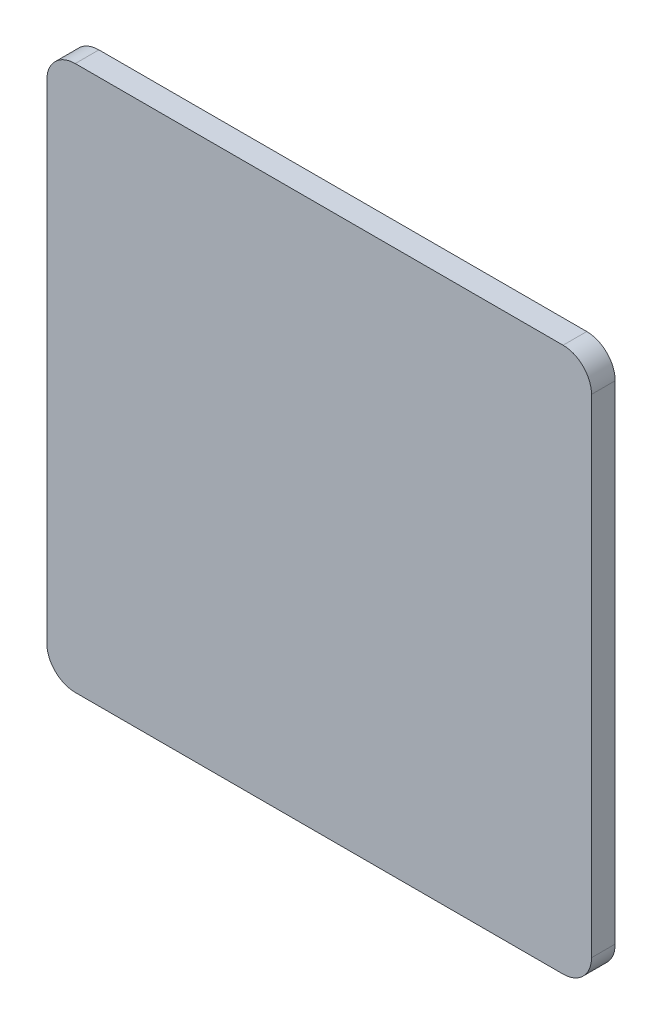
ISO-10303-21;
HEADER;
FILE_DESCRIPTION(('STEP AP214'),'2;1');
FILE_NAME('part.step','',(''),(''),'','','');
FILE_SCHEMA(('AUTOMOTIVE_DESIGN { 1 0 10303 214 1 1 1 1 }'));
ENDSEC;
DATA;
#1=APPLICATION_CONTEXT('core data for automotive mechanical design processes');
#2=APPLICATION_PROTOCOL_DEFINITION('international standard','automotive_design',2000,#1);
#3=PRODUCT_CONTEXT('',#1,'mechanical');
#4=PRODUCT('Part','Part','',(#3));
#5=PRODUCT_RELATED_PRODUCT_CATEGORY('part','',(#4));
#6=PRODUCT_DEFINITION_FORMATION('','',#4);
#7=PRODUCT_DEFINITION_CONTEXT('part definition',#1,'design');
#8=PRODUCT_DEFINITION('design','',#6,#7);
#9=PRODUCT_DEFINITION_SHAPE('','',#8);
#10=(LENGTH_UNIT() NAMED_UNIT(*) SI_UNIT(.MILLI.,.METRE.));
#11=(NAMED_UNIT(*) PLANE_ANGLE_UNIT() SI_UNIT($,.RADIAN.));
#12=(NAMED_UNIT(*) SI_UNIT($,.STERADIAN.) SOLID_ANGLE_UNIT());
#13=UNCERTAINTY_MEASURE_WITH_UNIT(LENGTH_MEASURE(1.E-05),#10,'distance_accuracy_value','');
#14=(GEOMETRIC_REPRESENTATION_CONTEXT(3) GLOBAL_UNCERTAINTY_ASSIGNED_CONTEXT((#13)) GLOBAL_UNIT_ASSIGNED_CONTEXT((#10,
#11,#12)) REPRESENTATION_CONTEXT('',''));
#15=CARTESIAN_POINT('',(0.,0.,0.));
#16=DIRECTION('',(0.,0.,1.));
#17=DIRECTION('',(1.,0.,0.));
#18=AXIS2_PLACEMENT_3D('',#15,#16,#17);
#19=CARTESIAN_POINT('',(65.405,65.405,212.895890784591));
#20=DIRECTION('',(0.,0.,-1.));
#21=DIRECTION('',(-1.,0.,0.));
#22=AXIS2_PLACEMENT_3D('',#19,#20,#21);
#23=CYLINDRICAL_SURFACE('',#22,7.62);
#24=CARTESIAN_POINT('',(65.405,65.405,6.34999999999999));
#25=DIRECTION('',(0.,0.,1.));
#26=DIRECTION('',(1.,0.,0.));
#27=AXIS2_PLACEMENT_3D('',#24,#25,#26);
#28=CIRCLE('',#27,7.62);
#29=CARTESIAN_POINT('',(73.025,65.405,6.34999999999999));
#30=VERTEX_POINT('',#29);
#31=CARTESIAN_POINT('',(65.405,73.025,6.34999999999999));
#32=VERTEX_POINT('',#31);
#33=EDGE_CURVE('E129',#30,#32,#28,.T.);
#34=ORIENTED_EDGE('',*,*,#33,.F.);
#35=DIRECTION('',(0.,0.,-1.));
#36=VECTOR('',#35,1.);
#37=CARTESIAN_POINT('',(73.025,65.405,212.895890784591));
#38=LINE('',#37,#36);
#39=CARTESIAN_POINT('',(73.025,65.405,0.));
#40=VERTEX_POINT('',#39);
#41=EDGE_CURVE('E34',#30,#40,#38,.T.);
#42=ORIENTED_EDGE('',*,*,#41,.T.);
#43=CARTESIAN_POINT('',(65.405,65.405,0.));
#44=DIRECTION('',(0.,0.,1.));
#45=DIRECTION('',(1.,0.,0.));
#46=AXIS2_PLACEMENT_3D('',#43,#44,#45);
#47=CIRCLE('',#46,7.62);
#48=CARTESIAN_POINT('',(65.405,73.025,0.));
#49=VERTEX_POINT('',#48);
#50=EDGE_CURVE('E137',#40,#49,#47,.T.);
#51=ORIENTED_EDGE('',*,*,#50,.T.);
#52=DIRECTION('',(0.,0.,-1.));
#53=VECTOR('',#52,1.);
#54=CARTESIAN_POINT('',(65.405,73.025,212.895890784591));
#55=LINE('',#54,#53);
#56=EDGE_CURVE('E85',#32,#49,#55,.T.);
#57=ORIENTED_EDGE('',*,*,#56,.F.);
#58=EDGE_LOOP('',(#34,#42,#51,#57));
#59=FACE_BOUND('',#58,.T.);
#60=ADVANCED_FACE('F30',(#59),#23,.T.);
#61=CARTESIAN_POINT('',(65.405,73.025,212.895890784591));
#62=DIRECTION('',(0.,-1.,0.));
#63=DIRECTION('',(0.,0.,-1.));
#64=AXIS2_PLACEMENT_3D('',#61,#62,#63);
#65=PLANE('',#64);
#66=DIRECTION('',(-1.,0.,0.));
#67=VECTOR('',#66,1.);
#68=CARTESIAN_POINT('',(65.405,73.025,6.34999999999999));
#69=LINE('',#68,#67);
#70=CARTESIAN_POINT('',(-65.405,73.025,6.34999999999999));
#71=VERTEX_POINT('',#70);
#72=EDGE_CURVE('E92',#32,#71,#69,.T.);
#73=ORIENTED_EDGE('',*,*,#72,.F.);
#74=ORIENTED_EDGE('',*,*,#56,.T.);
#75=DIRECTION('',(-1.,0.,0.));
#76=VECTOR('',#75,1.);
#77=CARTESIAN_POINT('',(65.405,73.025,0.));
#78=LINE('',#77,#76);
#79=CARTESIAN_POINT('',(-65.405,73.025,0.));
#80=VERTEX_POINT('',#79);
#81=EDGE_CURVE('E136',#49,#80,#78,.T.);
#82=ORIENTED_EDGE('',*,*,#81,.T.);
#83=DIRECTION('',(0.,0.,-1.));
#84=VECTOR('',#83,1.);
#85=CARTESIAN_POINT('',(-65.405,73.025,212.895890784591));
#86=LINE('',#85,#84);
#87=EDGE_CURVE('E138',#71,#80,#86,.T.);
#88=ORIENTED_EDGE('',*,*,#87,.F.);
#89=EDGE_LOOP('',(#73,#74,#82,#88));
#90=FACE_BOUND('',#89,.T.);
#91=ADVANCED_FACE('F167',(#90),#65,.F.);
#92=CARTESIAN_POINT('',(-65.405,65.405,212.895890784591));
#93=DIRECTION('',(0.,0.,-1.));
#94=DIRECTION('',(-1.,0.,0.));
#95=AXIS2_PLACEMENT_3D('',#92,#93,#94);
#96=CYLINDRICAL_SURFACE('',#95,7.62);
#97=CARTESIAN_POINT('',(-65.405,65.405,6.34999999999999));
#98=DIRECTION('',(0.,0.,1.));
#99=DIRECTION('',(1.,0.,0.));
#100=AXIS2_PLACEMENT_3D('',#97,#98,#99);
#101=CIRCLE('',#100,7.62);
#102=CARTESIAN_POINT('',(-73.025,65.405,6.34999999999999));
#103=VERTEX_POINT('',#102);
#104=EDGE_CURVE('E125',#71,#103,#101,.T.);
#105=ORIENTED_EDGE('',*,*,#104,.F.);
#106=ORIENTED_EDGE('',*,*,#87,.T.);
#107=CARTESIAN_POINT('',(-65.405,65.405,0.));
#108=DIRECTION('',(0.,0.,1.));
#109=DIRECTION('',(1.,0.,0.));
#110=AXIS2_PLACEMENT_3D('',#107,#108,#109);
#111=CIRCLE('',#110,7.62);
#112=CARTESIAN_POINT('',(-73.025,65.405,0.));
#113=VERTEX_POINT('',#112);
#114=EDGE_CURVE('E140',#80,#113,#111,.T.);
#115=ORIENTED_EDGE('',*,*,#114,.T.);
#116=DIRECTION('',(0.,0.,-1.));
#117=VECTOR('',#116,1.);
#118=CARTESIAN_POINT('',(-73.025,65.405,212.895890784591));
#119=LINE('',#118,#117);
#120=EDGE_CURVE('E141',#103,#113,#119,.T.);
#121=ORIENTED_EDGE('',*,*,#120,.F.);
#122=EDGE_LOOP('',(#105,#106,#115,#121));
#123=FACE_BOUND('',#122,.T.);
#124=ADVANCED_FACE('F170',(#123),#96,.T.);
#125=CARTESIAN_POINT('',(-73.025,65.405,212.895890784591));
#126=DIRECTION('',(1.,0.,0.));
#127=DIRECTION('',(0.,0.,-1.));
#128=AXIS2_PLACEMENT_3D('',#125,#126,#127);
#129=PLANE('',#128);
#130=DIRECTION('',(0.,-1.,0.));
#131=VECTOR('',#130,1.);
#132=CARTESIAN_POINT('',(-73.025,65.405,6.34999999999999));
#133=LINE('',#132,#131);
#134=CARTESIAN_POINT('',(-73.025,-65.405,6.34999999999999));
#135=VERTEX_POINT('',#134);
#136=EDGE_CURVE('E120',#103,#135,#133,.T.);
#137=ORIENTED_EDGE('',*,*,#136,.F.);
#138=ORIENTED_EDGE('',*,*,#120,.T.);
#139=DIRECTION('',(0.,-1.,0.));
#140=VECTOR('',#139,1.);
#141=CARTESIAN_POINT('',(-73.025,65.405,0.));
#142=LINE('',#141,#140);
#143=CARTESIAN_POINT('',(-73.025,-65.405,0.));
#144=VERTEX_POINT('',#143);
#145=EDGE_CURVE('E143',#113,#144,#142,.T.);
#146=ORIENTED_EDGE('',*,*,#145,.T.);
#147=DIRECTION('',(0.,0.,-1.));
#148=VECTOR('',#147,1.);
#149=CARTESIAN_POINT('',(-73.025,-65.405,212.895890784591));
#150=LINE('',#149,#148);
#151=EDGE_CURVE('E144',#135,#144,#150,.T.);
#152=ORIENTED_EDGE('',*,*,#151,.F.);
#153=EDGE_LOOP('',(#137,#138,#146,#152));
#154=FACE_BOUND('',#153,.T.);
#155=ADVANCED_FACE('F172',(#154),#129,.F.);
#156=CARTESIAN_POINT('',(-65.405,-65.405,212.895890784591));
#157=DIRECTION('',(0.,0.,-1.));
#158=DIRECTION('',(-1.,0.,0.));
#159=AXIS2_PLACEMENT_3D('',#156,#157,#158);
#160=CYLINDRICAL_SURFACE('',#159,7.62);
#161=CARTESIAN_POINT('',(-65.405,-65.405,6.34999999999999));
#162=DIRECTION('',(0.,0.,1.));
#163=DIRECTION('',(1.,0.,0.));
#164=AXIS2_PLACEMENT_3D('',#161,#162,#163);
#165=CIRCLE('',#164,7.62);
#166=CARTESIAN_POINT('',(-65.405,-73.025,6.34999999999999));
#167=VERTEX_POINT('',#166);
#168=EDGE_CURVE('E118',#135,#167,#165,.T.);
#169=ORIENTED_EDGE('',*,*,#168,.F.);
#170=ORIENTED_EDGE('',*,*,#151,.T.);
#171=CARTESIAN_POINT('',(-65.405,-65.405,0.));
#172=DIRECTION('',(0.,0.,1.));
#173=DIRECTION('',(1.,0.,0.));
#174=AXIS2_PLACEMENT_3D('',#171,#172,#173);
#175=CIRCLE('',#174,7.62);
#176=CARTESIAN_POINT('',(-65.405,-73.025,0.));
#177=VERTEX_POINT('',#176);
#178=EDGE_CURVE('E146',#144,#177,#175,.T.);
#179=ORIENTED_EDGE('',*,*,#178,.T.);
#180=DIRECTION('',(0.,0.,-1.));
#181=VECTOR('',#180,1.);
#182=CARTESIAN_POINT('',(-65.405,-73.025,212.895890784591));
#183=LINE('',#182,#181);
#184=EDGE_CURVE('E147',#167,#177,#183,.T.);
#185=ORIENTED_EDGE('',*,*,#184,.F.);
#186=EDGE_LOOP('',(#169,#170,#179,#185));
#187=FACE_BOUND('',#186,.T.);
#188=ADVANCED_FACE('F176',(#187),#160,.T.);
#189=CARTESIAN_POINT('',(-65.405,-73.025,212.895890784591));
#190=DIRECTION('',(0.,1.,0.));
#191=DIRECTION('',(0.,0.,1.));
#192=AXIS2_PLACEMENT_3D('',#189,#190,#191);
#193=PLANE('',#192);
#194=DIRECTION('',(1.,0.,0.));
#195=VECTOR('',#194,1.);
#196=CARTESIAN_POINT('',(-65.405,-73.025,6.34999999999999));
#197=LINE('',#196,#195);
#198=CARTESIAN_POINT('',(65.405,-73.025,6.34999999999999));
#199=VERTEX_POINT('',#198);
#200=EDGE_CURVE('E39',#167,#199,#197,.T.);
#201=ORIENTED_EDGE('',*,*,#200,.F.);
#202=ORIENTED_EDGE('',*,*,#184,.T.);
#203=DIRECTION('',(1.,0.,0.));
#204=VECTOR('',#203,1.);
#205=CARTESIAN_POINT('',(-65.405,-73.025,0.));
#206=LINE('',#205,#204);
#207=CARTESIAN_POINT('',(65.405,-73.025,0.));
#208=VERTEX_POINT('',#207);
#209=EDGE_CURVE('E112',#177,#208,#206,.T.);
#210=ORIENTED_EDGE('',*,*,#209,.T.);
#211=DIRECTION('',(0.,0.,-1.));
#212=VECTOR('',#211,1.);
#213=CARTESIAN_POINT('',(65.405,-73.025,212.895890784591));
#214=LINE('',#213,#212);
#215=EDGE_CURVE('E103',#199,#208,#214,.T.);
#216=ORIENTED_EDGE('',*,*,#215,.F.);
#217=EDGE_LOOP('',(#201,#202,#210,#216));
#218=FACE_BOUND('',#217,.T.);
#219=ADVANCED_FACE('F109',(#218),#193,.F.);
#220=CARTESIAN_POINT('',(65.405,-65.405,212.895890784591));
#221=DIRECTION('',(0.,0.,-1.));
#222=DIRECTION('',(-1.,0.,0.));
#223=AXIS2_PLACEMENT_3D('',#220,#221,#222);
#224=CYLINDRICAL_SURFACE('',#223,7.62);
#225=CARTESIAN_POINT('',(65.405,-65.405,6.34999999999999));
#226=DIRECTION('',(0.,0.,1.));
#227=DIRECTION('',(1.,0.,0.));
#228=AXIS2_PLACEMENT_3D('',#225,#226,#227);
#229=CIRCLE('',#228,7.62);
#230=CARTESIAN_POINT('',(73.025,-65.405,6.34999999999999));
#231=VERTEX_POINT('',#230);
#232=EDGE_CURVE('E11',#199,#231,#229,.T.);
#233=ORIENTED_EDGE('',*,*,#232,.F.);
#234=ORIENTED_EDGE('',*,*,#215,.T.);
#235=CARTESIAN_POINT('',(65.405,-65.405,0.));
#236=DIRECTION('',(0.,0.,1.));
#237=DIRECTION('',(1.,0.,0.));
#238=AXIS2_PLACEMENT_3D('',#235,#236,#237);
#239=CIRCLE('',#238,7.62);
#240=CARTESIAN_POINT('',(73.025,-65.405,0.));
#241=VERTEX_POINT('',#240);
#242=EDGE_CURVE('E114',#208,#241,#239,.T.);
#243=ORIENTED_EDGE('',*,*,#242,.T.);
#244=DIRECTION('',(0.,0.,-1.));
#245=VECTOR('',#244,1.);
#246=CARTESIAN_POINT('',(73.025,-65.405,212.895890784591));
#247=LINE('',#246,#245);
#248=EDGE_CURVE('E52',#231,#241,#247,.T.);
#249=ORIENTED_EDGE('',*,*,#248,.F.);
#250=EDGE_LOOP('',(#233,#234,#243,#249));
#251=FACE_BOUND('',#250,.T.);
#252=ADVANCED_FACE('F102',(#251),#224,.T.);
#253=CARTESIAN_POINT('',(73.025,-65.405,212.895890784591));
#254=DIRECTION('',(-1.,0.,0.));
#255=DIRECTION('',(0.,-1.,0.));
#256=AXIS2_PLACEMENT_3D('',#253,#254,#255);
#257=PLANE('',#256);
#258=DIRECTION('',(0.,1.,0.));
#259=VECTOR('',#258,1.);
#260=CARTESIAN_POINT('',(73.025,-65.405,6.34999999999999));
#261=LINE('',#260,#259);
#262=EDGE_CURVE('E132',#231,#30,#261,.T.);
#263=ORIENTED_EDGE('',*,*,#262,.F.);
#264=ORIENTED_EDGE('',*,*,#248,.T.);
#265=DIRECTION('',(0.,1.,0.));
#266=VECTOR('',#265,1.);
#267=CARTESIAN_POINT('',(73.025,-65.405,0.));
#268=LINE('',#267,#266);
#269=EDGE_CURVE('E134',#241,#40,#268,.T.);
#270=ORIENTED_EDGE('',*,*,#269,.T.);
#271=ORIENTED_EDGE('',*,*,#41,.F.);
#272=EDGE_LOOP('',(#263,#264,#270,#271));
#273=FACE_BOUND('',#272,.T.);
#274=ADVANCED_FACE('F162',(#273),#257,.F.);
#275=CARTESIAN_POINT('',(65.405,65.405,0.));
#276=DIRECTION('',(0.,0.,1.));
#277=DIRECTION('',(1.,0.,0.));
#278=AXIS2_PLACEMENT_3D('',#275,#276,#277);
#279=PLANE('',#278);
#280=ORIENTED_EDGE('',*,*,#50,.F.);
#281=ORIENTED_EDGE('',*,*,#269,.F.);
#282=ORIENTED_EDGE('',*,*,#242,.F.);
#283=ORIENTED_EDGE('',*,*,#209,.F.);
#284=ORIENTED_EDGE('',*,*,#178,.F.);
#285=ORIENTED_EDGE('',*,*,#145,.F.);
#286=ORIENTED_EDGE('',*,*,#114,.F.);
#287=ORIENTED_EDGE('',*,*,#81,.F.);
#288=EDGE_LOOP('',(#280,#281,#282,#283,#284,#285,#286,#287));
#289=FACE_BOUND('',#288,.T.);
#290=ADVANCED_FACE('F164',(#289),#279,.F.);
#291=CARTESIAN_POINT('',(76.2,-76.2,6.35));
#292=DIRECTION('',(0.,0.,1.));
#293=DIRECTION('',(0.,1.,0.));
#294=AXIS2_PLACEMENT_3D('',#291,#292,#293);
#295=PLANE('',#294);
#296=ORIENTED_EDGE('',*,*,#262,.T.);
#297=ORIENTED_EDGE('',*,*,#33,.T.);
#298=ORIENTED_EDGE('',*,*,#72,.T.);
#299=ORIENTED_EDGE('',*,*,#104,.T.);
#300=ORIENTED_EDGE('',*,*,#136,.T.);
#301=ORIENTED_EDGE('',*,*,#168,.T.);
#302=ORIENTED_EDGE('',*,*,#200,.T.);
#303=ORIENTED_EDGE('',*,*,#232,.T.);
#304=EDGE_LOOP('',(#296,#297,#298,#299,#300,#301,#302,#303));
#305=FACE_BOUND('',#304,.T.);
#306=ADVANCED_FACE('F32',(#305),#295,.T.);
#307=CLOSED_SHELL('',(#60,#91,#124,#155,#188,#219,#252,#274,#290,#306));
#308=MANIFOLD_SOLID_BREP('B2',#307);
#309=ADVANCED_BREP_SHAPE_REPRESENTATION('',(#18,#308),#14);
#310=SHAPE_DEFINITION_REPRESENTATION(#9,#309);
ENDSEC;
END-ISO-10303-21;
